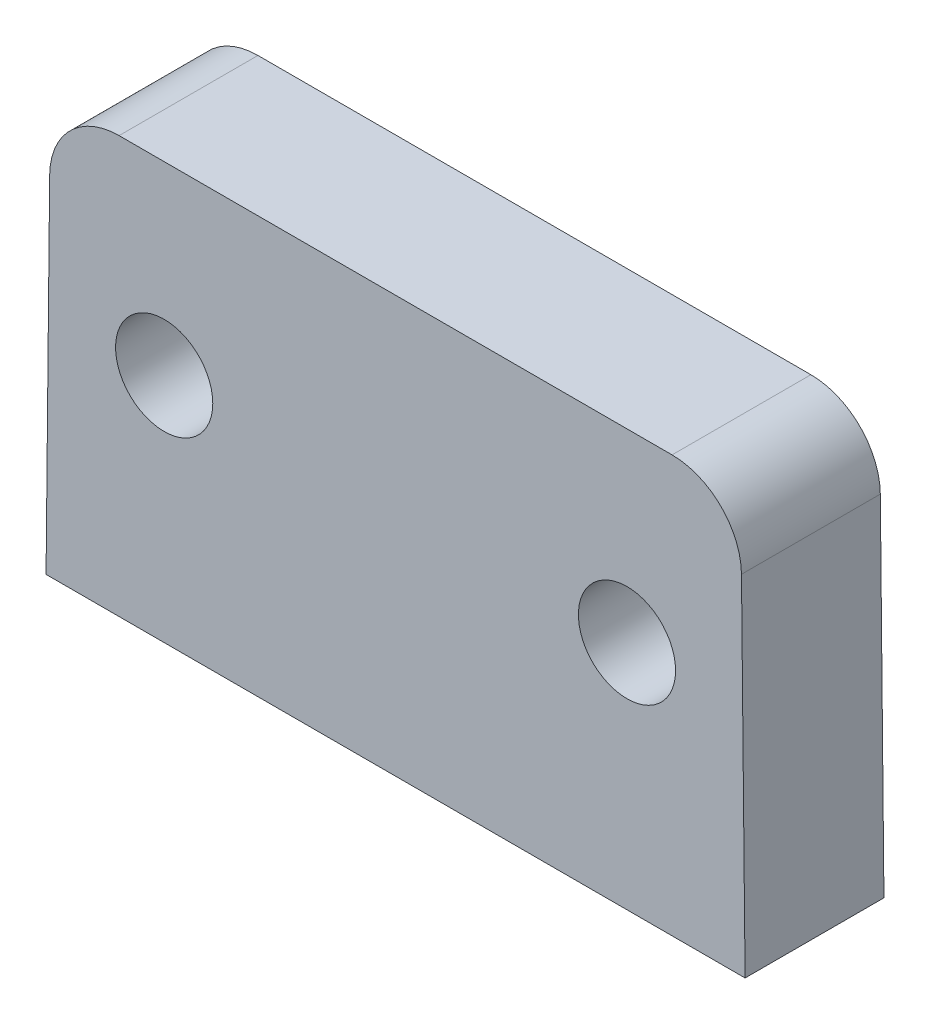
from build123d import *

# Parameters (mm, degrees)
SKETCH_1_R      = 2.1
EXTRUDE_1_DEPTH = 6


with BuildPart() as part:
    # Sketch 1 → Extrude 1 (new body)
    with BuildSketch(Plane.XY):
        with BuildLine():
            Line((0, 0), (30.208423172, 0))
            Line((30.208423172, 0), (30.052186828, 15.031180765))
            ThreePointArc((30.052186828, 15.031180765), (29.162616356, 17.132315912), (27.052348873, 18))
            Line((27.052348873, 18), (3.156074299, 18))
            ThreePointArc((3.156074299, 18), (1.045806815, 17.132315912), (0.156236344, 15.031180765))
            Line((0.156236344, 15.031180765), (0, 0))
        make_face()
        with Locations((5.104211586, 10)):
            Circle(SKETCH_1_R, mode=Mode.SUBTRACT)
        with Locations((25.104211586, 10)):
            Circle(SKETCH_1_R, mode=Mode.SUBTRACT)
    extrude(amount=EXTRUDE_1_DEPTH)


solid = part.part
